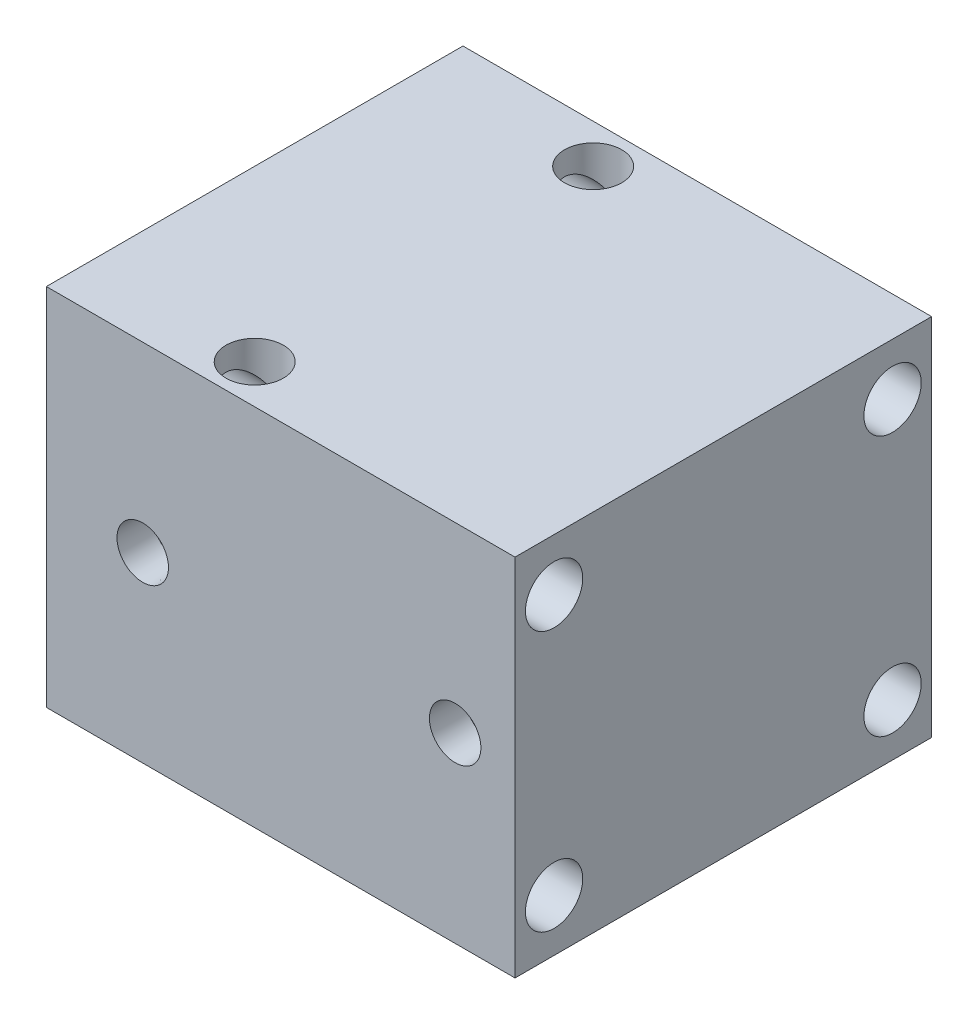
from build123d import *

# Parameters (mm, degrees)
SKETCH1_W                         = 180
SKETCH1_H                         = 160
SKETCH1_R                         = 11
EXTRUDE_H1_DEPTH                  = 140
SKETCH2_R                         = 1.5
CENTER_HOLE_DEPTH                 = 60
F_1_2_NPT_TAPPED_HOLE1_AT_2_COUNT = 2
F_1_2_NPT_TAPPED_HOLE1_AT_2_PITCH = 120
MTG_HOLE_REACH                    = 243.661
SKETCH6_R                         = 11
SKETCH5_R                         = 2
OIL_HOLE_DEPTH                    = 30


with BuildPart() as part:
    # Sketch1 → Extrude H1 (new body)
    with BuildSketch(Plane(origin=(0, 0, 0), x_dir=(1, 0, 0), z_dir=(0, 1, 0))):
        Rectangle(SKETCH1_W, SKETCH1_H)
        with Locations(Location((-25, 65, 0), (0, 0, 270))):
            Circle(SKETCH1_R, mode=Mode.SUBTRACT)
        with Locations(Location((-25, -65, 0), (0, 0, 270))):
            Circle(SKETCH1_R, mode=Mode.SUBTRACT)
    extrude(amount=EXTRUDE_H1_DEPTH)

    # Sketch2 → CENTER HOLE (cut)
    with BuildSketch(Plane.ZY.offset(90)):
        with Locations((0, 70)):
            Circle(SKETCH2_R)
    extrude(amount=-CENTER_HOLE_DEPTH, mode=Mode.SUBTRACT)

    # Sketch3 → 1_2 NPT Tapped Hole1 (revolve, cut)
    with BuildSketch(Plane(origin=(67, 70, 80), x_dir=(0, -1, 0), z_dir=(1, 0, 0))):
        Polygon((0, 0), (0, 28.004543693), (8.9281, 22.64), (8.9281, 13.57), (9.479718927, 13.57), (9.8860229, 0), align=None)
    f_1_2_npt_tapped_hole1 = revolve(axis=Axis((67, 70, 86.35), (0, 0, -1)), mode=Mode.SUBTRACT)

    # 1_2 NPT Tapped Hole1 at 2: 1_2 NPT Tapped Hole1 ×2
    with Locations(*[(-i * F_1_2_NPT_TAPPED_HOLE1_AT_2_PITCH, 0, 0) for i in range(1, F_1_2_NPT_TAPPED_HOLE1_AT_2_COUNT)]):
        add(f_1_2_npt_tapped_hole1, mode=Mode.SUBTRACT)

    # MTG HOLE: up to this face of the body (flat: up to its plane)
    mtg_hole_end = Plane(part.part.faces().sort_by_distance((90, 70, 0))[0])
    # Sketch6 → MTG HOLE (cut, up to the picked face)
    with BuildSketch(Plane.ZY.offset(90), mode=Mode.PRIVATE) as mtg_hole_sk1:
        with Locations((-65, 120)):
            Circle(SKETCH6_R)
    mtg_hole_tool1 = split(extrude(mtg_hole_sk1.sketch, amount=-MTG_HOLE_REACH, mode=Mode.PRIVATE), bisect_by=mtg_hole_end, keep=Keep.BOTH, mode=Mode.PRIVATE)
    # Sketch6 → MTG HOLE (cut, up to the picked face)
    with BuildSketch(Plane.ZY.offset(90), mode=Mode.PRIVATE) as mtg_hole_sk2:
        with Locations((-65, 20)):
            Circle(SKETCH6_R)
    mtg_hole_tool2 = split(extrude(mtg_hole_sk2.sketch, amount=-MTG_HOLE_REACH, mode=Mode.PRIVATE), bisect_by=mtg_hole_end, keep=Keep.BOTH, mode=Mode.PRIVATE)
    # Sketch6 → MTG HOLE (cut, up to the picked face)
    with BuildSketch(Plane.ZY.offset(90), mode=Mode.PRIVATE) as mtg_hole_sk3:
        with Locations((65, 120)):
            Circle(SKETCH6_R)
    mtg_hole_tool3 = split(extrude(mtg_hole_sk3.sketch, amount=-MTG_HOLE_REACH, mode=Mode.PRIVATE), bisect_by=mtg_hole_end, keep=Keep.BOTH, mode=Mode.PRIVATE)
    # Sketch6 → MTG HOLE (cut, up to the picked face)
    with BuildSketch(Plane.ZY.offset(90), mode=Mode.PRIVATE) as mtg_hole_sk4:
        with Locations((65, 20)):
            Circle(SKETCH6_R)
    mtg_hole_tool4 = split(extrude(mtg_hole_sk4.sketch, amount=-MTG_HOLE_REACH, mode=Mode.PRIVATE), bisect_by=mtg_hole_end, keep=Keep.BOTH, mode=Mode.PRIVATE)
    add(mtg_hole_tool1.solids().sort_by(Axis((-90, 120, -65), (1, 0, 0)))[0], mode=Mode.SUBTRACT)
    add(mtg_hole_tool2.solids().sort_by(Axis((-90, 20, -65), (1, 0, 0)))[0], mode=Mode.SUBTRACT)
    add(mtg_hole_tool3.solids().sort_by(Axis((-90, 120, 65), (1, 0, 0)))[0], mode=Mode.SUBTRACT)
    add(mtg_hole_tool4.solids().sort_by(Axis((-90, 20, 65), (1, 0, 0)))[0], mode=Mode.SUBTRACT)

    # Sketch5 → OIL HOLE (cut)
    with BuildSketch(Plane.XY.offset(80)):
        with Locations((-53, 70)):
            Circle(SKETCH5_R)
        with Locations((67, 70)):
            Circle(SKETCH5_R)
    extrude(amount=-OIL_HOLE_DEPTH, mode=Mode.SUBTRACT)


solid = part.part
